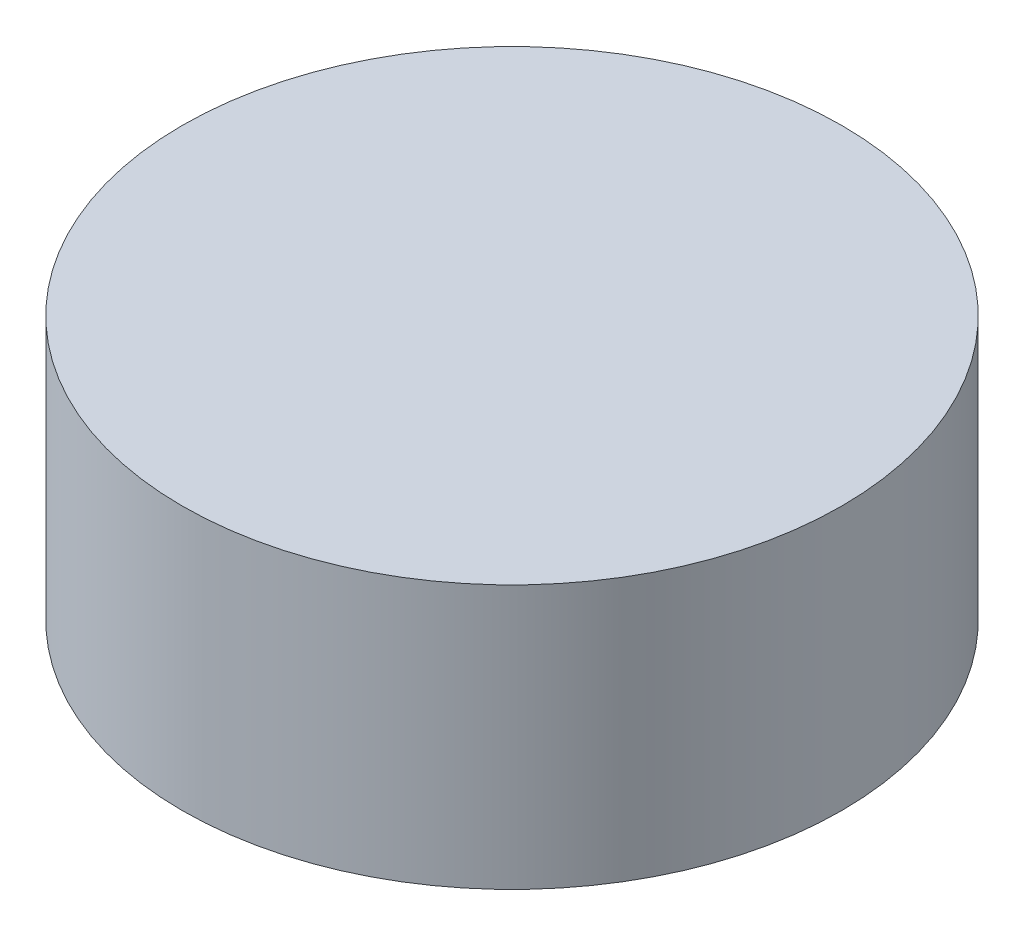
ISO-10303-21;
HEADER;
FILE_DESCRIPTION(('STEP AP214'),'2;1');
FILE_NAME('part.step','',(''),(''),'','','');
FILE_SCHEMA(('AUTOMOTIVE_DESIGN { 1 0 10303 214 1 1 1 1 }'));
ENDSEC;
DATA;
#1=APPLICATION_CONTEXT('core data for automotive mechanical design processes');
#2=APPLICATION_PROTOCOL_DEFINITION('international standard','automotive_design',2000,#1);
#3=PRODUCT_CONTEXT('',#1,'mechanical');
#4=PRODUCT('Part','Part','',(#3));
#5=PRODUCT_RELATED_PRODUCT_CATEGORY('part','',(#4));
#6=PRODUCT_DEFINITION_FORMATION('','',#4);
#7=PRODUCT_DEFINITION_CONTEXT('part definition',#1,'design');
#8=PRODUCT_DEFINITION('design','',#6,#7);
#9=PRODUCT_DEFINITION_SHAPE('','',#8);
#10=(LENGTH_UNIT() NAMED_UNIT(*) SI_UNIT(.MILLI.,.METRE.));
#11=(NAMED_UNIT(*) PLANE_ANGLE_UNIT() SI_UNIT($,.RADIAN.));
#12=(NAMED_UNIT(*) SI_UNIT($,.STERADIAN.) SOLID_ANGLE_UNIT());
#13=UNCERTAINTY_MEASURE_WITH_UNIT(LENGTH_MEASURE(1.E-05),#10,'distance_accuracy_value','');
#14=(GEOMETRIC_REPRESENTATION_CONTEXT(3) GLOBAL_UNCERTAINTY_ASSIGNED_CONTEXT((#13)) GLOBAL_UNIT_ASSIGNED_CONTEXT((#10,
#11,#12)) REPRESENTATION_CONTEXT('',''));
#15=CARTESIAN_POINT('',(0.,0.,0.));
#16=DIRECTION('',(0.,0.,1.));
#17=DIRECTION('',(1.,0.,0.));
#18=AXIS2_PLACEMENT_3D('',#15,#16,#17);
#19=CARTESIAN_POINT('',(0.,14.,0.));
#20=DIRECTION('',(0.,1.,0.));
#21=DIRECTION('',(0.,0.,1.));
#22=AXIS2_PLACEMENT_3D('',#19,#20,#21);
#23=PLANE('',#22);
#24=CARTESIAN_POINT('',(0.,14.,0.));
#25=DIRECTION('',(0.,1.,0.));
#26=DIRECTION('',(0.,0.,1.));
#27=AXIS2_PLACEMENT_3D('',#24,#25,#26);
#28=CIRCLE('',#27,35.);
#29=CARTESIAN_POINT('',(0.,14.,35.));
#30=VERTEX_POINT('',#29);
#31=EDGE_CURVE('E46',#30,#30,#28,.T.);
#32=ORIENTED_EDGE('',*,*,#31,.T.);
#33=EDGE_LOOP('',(#32));
#34=FACE_BOUND('',#33,.T.);
#35=ADVANCED_FACE('F38',(#34),#23,.T.);
#36=CARTESIAN_POINT('',(0.,-14.,0.));
#37=DIRECTION('',(0.,1.,0.));
#38=DIRECTION('',(0.,0.,1.));
#39=AXIS2_PLACEMENT_3D('',#36,#37,#38);
#40=PLANE('',#39);
#41=CARTESIAN_POINT('',(0.,-14.,0.));
#42=DIRECTION('',(0.,1.,0.));
#43=DIRECTION('',(0.,0.,1.));
#44=AXIS2_PLACEMENT_3D('',#41,#42,#43);
#45=CIRCLE('',#44,35.);
#46=CARTESIAN_POINT('',(0.,-14.,35.));
#47=VERTEX_POINT('',#46);
#48=EDGE_CURVE('E50',#47,#47,#45,.T.);
#49=ORIENTED_EDGE('',*,*,#48,.F.);
#50=EDGE_LOOP('',(#49));
#51=FACE_BOUND('',#50,.T.);
#52=ADVANCED_FACE('F77',(#51),#40,.F.);
#53=CARTESIAN_POINT('',(0.,14.,0.));
#54=DIRECTION('',(0.,-1.,0.));
#55=DIRECTION('',(0.,0.,-1.));
#56=AXIS2_PLACEMENT_3D('',#53,#54,#55);
#57=CYLINDRICAL_SURFACE('',#56,35.);
#58=ORIENTED_EDGE('',*,*,#31,.F.);
#59=EDGE_LOOP('',(#58));
#60=FACE_BOUND('',#59,.T.);
#61=ORIENTED_EDGE('',*,*,#48,.T.);
#62=EDGE_LOOP('',(#61));
#63=FACE_BOUND('',#62,.T.);
#64=ADVANCED_FACE('F40',(#60,#63),#57,.T.);
#65=CLOSED_SHELL('',(#35,#52,#64));
#66=CARTESIAN_POINT('',(0.,9.,0.));
#67=DIRECTION('',(0.,1.,0.));
#68=DIRECTION('',(0.,0.,1.));
#69=AXIS2_PLACEMENT_3D('',#66,#67,#68);
#70=PLANE('',#69);
#71=CARTESIAN_POINT('',(0.,9.,0.));
#72=DIRECTION('',(0.,1.,0.));
#73=DIRECTION('',(0.,0.,1.));
#74=AXIS2_PLACEMENT_3D('',#71,#72,#73);
#75=CIRCLE('',#74,30.);
#76=CARTESIAN_POINT('',(0.,9.,30.));
#77=VERTEX_POINT('',#76);
#78=EDGE_CURVE('E55',#77,#77,#75,.T.);
#79=ORIENTED_EDGE('',*,*,#78,.F.);
#80=EDGE_LOOP('',(#79));
#81=FACE_BOUND('',#80,.T.);
#82=ADVANCED_FACE('F62',(#81),#70,.F.);
#83=CARTESIAN_POINT('',(0.,-9.,0.));
#84=DIRECTION('',(0.,1.,0.));
#85=DIRECTION('',(0.,0.,1.));
#86=AXIS2_PLACEMENT_3D('',#83,#84,#85);
#87=PLANE('',#86);
#88=CARTESIAN_POINT('',(0.,-9.,0.));
#89=DIRECTION('',(0.,1.,0.));
#90=DIRECTION('',(0.,0.,1.));
#91=AXIS2_PLACEMENT_3D('',#88,#89,#90);
#92=CIRCLE('',#91,30.);
#93=CARTESIAN_POINT('',(0.,-9.,30.));
#94=VERTEX_POINT('',#93);
#95=EDGE_CURVE('E10',#94,#94,#92,.T.);
#96=ORIENTED_EDGE('',*,*,#95,.T.);
#97=EDGE_LOOP('',(#96));
#98=FACE_BOUND('',#97,.T.);
#99=ADVANCED_FACE('F64',(#98),#87,.T.);
#100=CARTESIAN_POINT('',(0.,14.,0.));
#101=DIRECTION('',(0.,-1.,0.));
#102=DIRECTION('',(0.,0.,-1.));
#103=AXIS2_PLACEMENT_3D('',#100,#101,#102);
#104=CYLINDRICAL_SURFACE('',#103,30.);
#105=ORIENTED_EDGE('',*,*,#95,.F.);
#106=EDGE_LOOP('',(#105));
#107=FACE_BOUND('',#106,.T.);
#108=ORIENTED_EDGE('',*,*,#78,.T.);
#109=EDGE_LOOP('',(#108));
#110=FACE_BOUND('',#109,.T.);
#111=ADVANCED_FACE('F60',(#107,#110),#104,.F.);
#112=CLOSED_SHELL('',(#82,#99,#111));
#113=ORIENTED_CLOSED_SHELL('',*,#112,.T.);
#114=BREP_WITH_VOIDS('B2',#65,(#113));
#115=ADVANCED_BREP_SHAPE_REPRESENTATION('',(#18,#114),#14);
#116=SHAPE_DEFINITION_REPRESENTATION(#9,#115);
ENDSEC;
END-ISO-10303-21;
